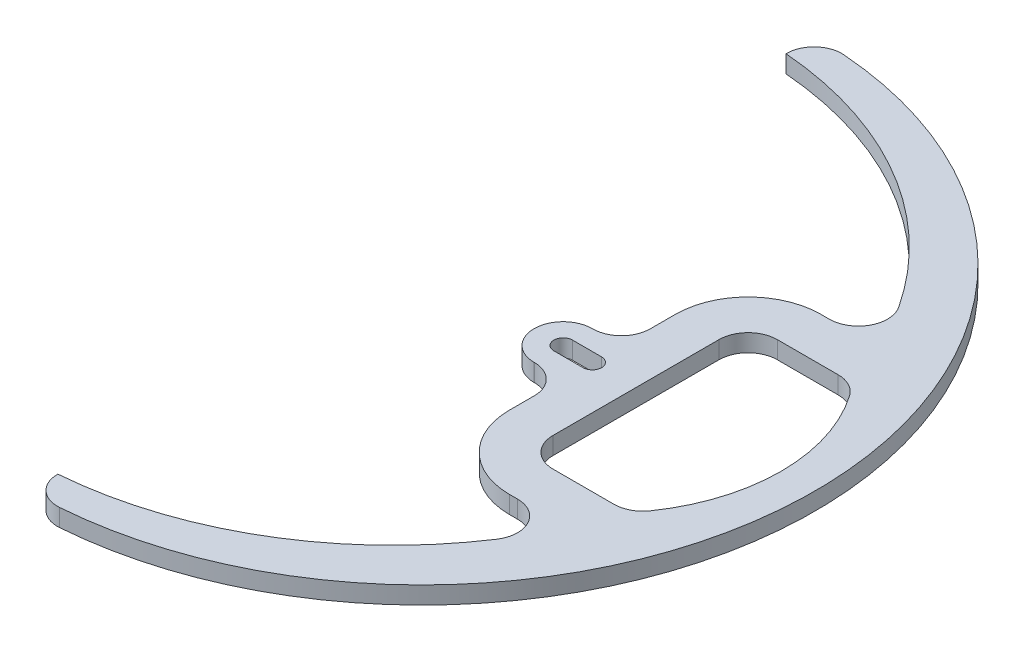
ISO-10303-21;
HEADER;
FILE_DESCRIPTION(('STEP AP214'),'2;1');
FILE_NAME('part.step','',(''),(''),'','','');
FILE_SCHEMA(('AUTOMOTIVE_DESIGN { 1 0 10303 214 1 1 1 1 }'));
ENDSEC;
DATA;
#1=APPLICATION_CONTEXT('core data for automotive mechanical design processes');
#2=APPLICATION_PROTOCOL_DEFINITION('international standard','automotive_design',2000,#1);
#3=PRODUCT_CONTEXT('',#1,'mechanical');
#4=PRODUCT('Part','Part','',(#3));
#5=PRODUCT_RELATED_PRODUCT_CATEGORY('part','',(#4));
#6=PRODUCT_DEFINITION_FORMATION('','',#4);
#7=PRODUCT_DEFINITION_CONTEXT('part definition',#1,'design');
#8=PRODUCT_DEFINITION('design','',#6,#7);
#9=PRODUCT_DEFINITION_SHAPE('','',#8);
#10=(LENGTH_UNIT() NAMED_UNIT(*) SI_UNIT(.MILLI.,.METRE.));
#11=(NAMED_UNIT(*) PLANE_ANGLE_UNIT() SI_UNIT($,.RADIAN.));
#12=(NAMED_UNIT(*) SI_UNIT($,.STERADIAN.) SOLID_ANGLE_UNIT());
#13=UNCERTAINTY_MEASURE_WITH_UNIT(LENGTH_MEASURE(1.E-05),#10,'distance_accuracy_value','');
#14=(GEOMETRIC_REPRESENTATION_CONTEXT(3) GLOBAL_UNCERTAINTY_ASSIGNED_CONTEXT((#13)) GLOBAL_UNIT_ASSIGNED_CONTEXT((#10,
#11,#12)) REPRESENTATION_CONTEXT('',''));
#15=CARTESIAN_POINT('',(0.,0.,0.));
#16=DIRECTION('',(0.,0.,1.));
#17=DIRECTION('',(1.,0.,0.));
#18=AXIS2_PLACEMENT_3D('',#15,#16,#17);
#19=CARTESIAN_POINT('',(40.,6.,0.));
#20=DIRECTION('',(0.,1.,0.));
#21=DIRECTION('',(0.,0.,1.));
#22=AXIS2_PLACEMENT_3D('',#19,#20,#21);
#23=PLANE('',#22);
#24=DIRECTION('',(-1.,0.,0.));
#25=VECTOR('',#24,1.);
#26=CARTESIAN_POINT('',(98.5,6.,-3.2));
#27=LINE('',#26,#25);
#28=CARTESIAN_POINT('',(108.5,6.,-3.2));
#29=VERTEX_POINT('',#28);
#30=CARTESIAN_POINT('',(98.5,6.,-3.2));
#31=VERTEX_POINT('',#30);
#32=EDGE_CURVE('E316',#29,#31,#27,.T.);
#33=ORIENTED_EDGE('',*,*,#32,.F.);
#34=CARTESIAN_POINT('',(108.5,6.,0.));
#35=DIRECTION('',(0.,1.,0.));
#36=DIRECTION('',(0.,0.,1.));
#37=AXIS2_PLACEMENT_3D('',#34,#35,#36);
#38=CIRCLE('',#37,3.2);
#39=CARTESIAN_POINT('',(108.5,6.,3.2));
#40=VERTEX_POINT('',#39);
#41=EDGE_CURVE('E314',#40,#29,#38,.T.);
#42=ORIENTED_EDGE('',*,*,#41,.F.);
#43=DIRECTION('',(1.,0.,0.));
#44=VECTOR('',#43,1.);
#45=CARTESIAN_POINT('',(98.5,6.,3.2));
#46=LINE('',#45,#44);
#47=CARTESIAN_POINT('',(98.5,6.,3.2));
#48=VERTEX_POINT('',#47);
#49=EDGE_CURVE('E321',#48,#40,#46,.T.);
#50=ORIENTED_EDGE('',*,*,#49,.F.);
#51=CARTESIAN_POINT('',(98.5,6.,0.));
#52=DIRECTION('',(0.,1.,0.));
#53=DIRECTION('',(0.,0.,1.));
#54=AXIS2_PLACEMENT_3D('',#51,#52,#53);
#55=CIRCLE('',#54,3.2);
#56=EDGE_CURVE('E318',#31,#48,#55,.T.);
#57=ORIENTED_EDGE('',*,*,#56,.F.);
#58=EDGE_LOOP('',(#33,#42,#50,#57));
#59=FACE_BOUND('',#58,.T.);
#60=CARTESIAN_POINT('',(40.,6.,0.));
#61=DIRECTION('',(0.,-1.,0.));
#62=DIRECTION('',(0.,0.,1.));
#63=AXIS2_PLACEMENT_3D('',#60,#61,#62);
#64=CIRCLE('',#63,125.399362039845);
#65=CARTESIAN_POINT('',(50.,6.,-125.));
#66=VERTEX_POINT('',#65);
#67=CARTESIAN_POINT('',(144.707387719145,6.,-69.0026300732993));
#68=VERTEX_POINT('',#67);
#69=EDGE_CURVE('E374',#66,#68,#64,.T.);
#70=ORIENTED_EDGE('',*,*,#69,.T.);
#71=CARTESIAN_POINT('',(136.357473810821,6.,-63.5));
#72=DIRECTION('',(0.,-1.,0.));
#73=DIRECTION('',(0.,0.,-1.));
#74=AXIS2_PLACEMENT_3D('',#71,#72,#73);
#75=CIRCLE('',#74,10.0000000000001);
#76=CARTESIAN_POINT('',(136.357473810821,6.,-53.4999999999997));
#77=VERTEX_POINT('',#76);
#78=EDGE_CURVE('E377',#68,#77,#75,.T.);
#79=ORIENTED_EDGE('',*,*,#78,.T.);
#80=DIRECTION('',(-1.,0.,0.));
#81=VECTOR('',#80,1.);
#82=CARTESIAN_POINT('',(133.5,6.,-53.4999999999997));
#83=LINE('',#82,#81);
#84=CARTESIAN_POINT('',(133.5,6.,-53.4999999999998));
#85=VERTEX_POINT('',#84);
#86=EDGE_CURVE('E379',#77,#85,#83,.T.);
#87=ORIENTED_EDGE('',*,*,#86,.T.);
#88=CARTESIAN_POINT('',(133.5,6.,-28.5));
#89=DIRECTION('',(0.,1.,0.));
#90=DIRECTION('',(0.,0.,-1.));
#91=AXIS2_PLACEMENT_3D('',#88,#89,#90);
#92=CIRCLE('',#91,24.9999999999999);
#93=CARTESIAN_POINT('',(108.5,6.,-28.4999999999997));
#94=VERTEX_POINT('',#93);
#95=EDGE_CURVE('E381',#85,#94,#92,.T.);
#96=ORIENTED_EDGE('',*,*,#95,.T.);
#97=DIRECTION('',(0.,0.,1.));
#98=VECTOR('',#97,1.);
#99=CARTESIAN_POINT('',(108.5,6.,-28.4999999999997));
#100=LINE('',#99,#98);
#101=CARTESIAN_POINT('',(108.5,6.,-19.9000000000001));
#102=VERTEX_POINT('',#101);
#103=EDGE_CURVE('E383',#94,#102,#100,.T.);
#104=ORIENTED_EDGE('',*,*,#103,.T.);
#105=CARTESIAN_POINT('',(98.6,6.,-19.9));
#106=DIRECTION('',(0.,-1.,0.));
#107=DIRECTION('',(0.,0.,1.));
#108=AXIS2_PLACEMENT_3D('',#105,#106,#107);
#109=CIRCLE('',#108,9.9);
#110=CARTESIAN_POINT('',(98.5999999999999,6.,-10.));
#111=VERTEX_POINT('',#110);
#112=EDGE_CURVE('E385',#102,#111,#109,.T.);
#113=ORIENTED_EDGE('',*,*,#112,.T.);
#114=DIRECTION('',(-1.,0.,0.));
#115=VECTOR('',#114,1.);
#116=CARTESIAN_POINT('',(98.5,6.,-10.));
#117=LINE('',#116,#115);
#118=CARTESIAN_POINT('',(98.5,6.,-10.));
#119=VERTEX_POINT('',#118);
#120=EDGE_CURVE('E387',#111,#119,#117,.T.);
#121=ORIENTED_EDGE('',*,*,#120,.T.);
#122=CARTESIAN_POINT('',(98.5,6.,0.));
#123=DIRECTION('',(0.,1.,0.));
#124=DIRECTION('',(0.,0.,1.));
#125=AXIS2_PLACEMENT_3D('',#122,#123,#124);
#126=CIRCLE('',#125,10.);
#127=CARTESIAN_POINT('',(98.5,6.,10.));
#128=VERTEX_POINT('',#127);
#129=EDGE_CURVE('E389',#119,#128,#126,.T.);
#130=ORIENTED_EDGE('',*,*,#129,.T.);
#131=DIRECTION('',(1.,0.,0.));
#132=VECTOR('',#131,1.);
#133=CARTESIAN_POINT('',(98.5,6.,10.));
#134=LINE('',#133,#132);
#135=CARTESIAN_POINT('',(98.5999999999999,6.,10.));
#136=VERTEX_POINT('',#135);
#137=EDGE_CURVE('E391',#128,#136,#134,.T.);
#138=ORIENTED_EDGE('',*,*,#137,.T.);
#139=CARTESIAN_POINT('',(98.6,6.,19.9));
#140=DIRECTION('',(0.,-1.,0.));
#141=DIRECTION('',(0.,0.,1.));
#142=AXIS2_PLACEMENT_3D('',#139,#140,#141);
#143=CIRCLE('',#142,9.9);
#144=CARTESIAN_POINT('',(108.5,6.,19.9000000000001));
#145=VERTEX_POINT('',#144);
#146=EDGE_CURVE('E393',#136,#145,#143,.T.);
#147=ORIENTED_EDGE('',*,*,#146,.T.);
#148=DIRECTION('',(0.,0.,1.));
#149=VECTOR('',#148,1.);
#150=CARTESIAN_POINT('',(108.5,6.,19.9000000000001));
#151=LINE('',#150,#149);
#152=CARTESIAN_POINT('',(108.5,6.,28.4999999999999));
#153=VERTEX_POINT('',#152);
#154=EDGE_CURVE('E395',#145,#153,#151,.T.);
#155=ORIENTED_EDGE('',*,*,#154,.T.);
#156=CARTESIAN_POINT('',(133.5,6.,28.5));
#157=DIRECTION('',(0.,1.,0.));
#158=DIRECTION('',(0.,0.,1.));
#159=AXIS2_PLACEMENT_3D('',#156,#157,#158);
#160=CIRCLE('',#159,25.);
#161=CARTESIAN_POINT('',(133.5,6.,53.4999999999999));
#162=VERTEX_POINT('',#161);
#163=EDGE_CURVE('E397',#153,#162,#160,.T.);
#164=ORIENTED_EDGE('',*,*,#163,.T.);
#165=DIRECTION('',(1.,0.,0.));
#166=VECTOR('',#165,1.);
#167=CARTESIAN_POINT('',(133.5,6.,53.4999999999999));
#168=LINE('',#167,#166);
#169=CARTESIAN_POINT('',(136.357473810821,6.,53.4999999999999));
#170=VERTEX_POINT('',#169);
#171=EDGE_CURVE('E399',#162,#170,#168,.T.);
#172=ORIENTED_EDGE('',*,*,#171,.T.);
#173=CARTESIAN_POINT('',(136.357473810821,6.,63.5));
#174=DIRECTION('',(0.,-1.,0.));
#175=DIRECTION('',(0.,0.,1.));
#176=AXIS2_PLACEMENT_3D('',#173,#174,#175);
#177=CIRCLE('',#176,10.0000000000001);
#178=CARTESIAN_POINT('',(144.707387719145,6.,69.0026300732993));
#179=VERTEX_POINT('',#178);
#180=EDGE_CURVE('E401',#170,#179,#177,.T.);
#181=ORIENTED_EDGE('',*,*,#180,.T.);
#182=CARTESIAN_POINT('',(40.,6.,0.));
#183=DIRECTION('',(0.,-1.,0.));
#184=DIRECTION('',(0.,0.,1.));
#185=AXIS2_PLACEMENT_3D('',#182,#183,#184);
#186=CIRCLE('',#185,125.399362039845);
#187=CARTESIAN_POINT('',(50.,6.,125.));
#188=VERTEX_POINT('',#187);
#189=EDGE_CURVE('E403',#179,#188,#186,.T.);
#190=ORIENTED_EDGE('',*,*,#189,.T.);
#191=DIRECTION('',(0.,0.,1.));
#192=VECTOR('',#191,1.);
#193=CARTESIAN_POINT('',(50.,6.,125.));
#194=LINE('',#193,#192);
#195=CARTESIAN_POINT('',(50.,6.,125.139921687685));
#196=VERTEX_POINT('',#195);
#197=EDGE_CURVE('E405',#188,#196,#194,.T.);
#198=ORIENTED_EDGE('',*,*,#197,.T.);
#199=CARTESIAN_POINT('',(59.5,6.,125.139921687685));
#200=DIRECTION('',(0.,1.,0.));
#201=DIRECTION('',(0.,0.,1.));
#202=AXIS2_PLACEMENT_3D('',#199,#200,#201);
#203=CIRCLE('',#202,9.5);
#204=CARTESIAN_POINT('',(60.2191235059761,6.,134.612664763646));
#205=VERTEX_POINT('',#204);
#206=EDGE_CURVE('E407',#196,#205,#203,.T.);
#207=ORIENTED_EDGE('',*,*,#206,.T.);
#208=CARTESIAN_POINT('',(50.,6.,0.));
#209=DIRECTION('',(0.,1.,0.));
#210=DIRECTION('',(0.,0.,1.));
#211=AXIS2_PLACEMENT_3D('',#208,#209,#210);
#212=CIRCLE('',#211,135.);
#213=CARTESIAN_POINT('',(60.2191235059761,6.,-134.612664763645));
#214=VERTEX_POINT('',#213);
#215=EDGE_CURVE('E409',#205,#214,#212,.T.);
#216=ORIENTED_EDGE('',*,*,#215,.T.);
#217=CARTESIAN_POINT('',(59.5,6.,-125.139921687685));
#218=DIRECTION('',(0.,1.,0.));
#219=DIRECTION('',(0.,0.,-1.));
#220=AXIS2_PLACEMENT_3D('',#217,#218,#219);
#221=CIRCLE('',#220,9.5);
#222=CARTESIAN_POINT('',(50.,6.,-125.139921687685));
#223=VERTEX_POINT('',#222);
#224=EDGE_CURVE('E411',#214,#223,#221,.T.);
#225=ORIENTED_EDGE('',*,*,#224,.T.);
#226=DIRECTION('',(0.,0.,1.));
#227=VECTOR('',#226,1.);
#228=CARTESIAN_POINT('',(50.,6.,-125.139921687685));
#229=LINE('',#228,#227);
#230=EDGE_CURVE('E413',#223,#66,#229,.T.);
#231=ORIENTED_EDGE('',*,*,#230,.T.);
#232=EDGE_LOOP('',(#70,#79,#87,#96,#104,#113,#121,#130,#138,#147,#155,#164,#172,#181,#190,#198,
#207,#216,#225,#231));
#233=FACE_BOUND('',#232,.T.);
#234=CARTESIAN_POINT('',(113.323975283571,6.,1.65726909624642E-11));
#235=DIRECTION('',(0.,1.,0.));
#236=DIRECTION('',(0.,0.,-1.));
#237=AXIS2_PLACEMENT_3D('',#234,#235,#236);
#238=CIRCLE('',#237,59.9999999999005);
#239=CARTESIAN_POINT('',(162.622656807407,6.,34.200000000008));
#240=VERTEX_POINT('',#239);
#241=CARTESIAN_POINT('',(162.62265680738,6.,-34.2000000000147));
#242=VERTEX_POINT('',#241);
#243=EDGE_CURVE('E277',#240,#242,#238,.T.);
#244=ORIENTED_EDGE('',*,*,#243,.F.);
#245=CARTESIAN_POINT('',(154.406209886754,6.,28.5));
#246=DIRECTION('',(0.,1.,0.));
#247=DIRECTION('',(0.,0.,1.));
#248=AXIS2_PLACEMENT_3D('',#245,#246,#247);
#249=CIRCLE('',#248,10.);
#250=CARTESIAN_POINT('',(154.406209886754,6.,38.5));
#251=VERTEX_POINT('',#250);
#252=EDGE_CURVE('E254',#251,#240,#249,.T.);
#253=ORIENTED_EDGE('',*,*,#252,.F.);
#254=DIRECTION('',(1.,0.,0.));
#255=VECTOR('',#254,1.);
#256=CARTESIAN_POINT('',(133.499999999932,6.,38.5));
#257=LINE('',#256,#255);
#258=CARTESIAN_POINT('',(133.499999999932,6.,38.5));
#259=VERTEX_POINT('',#258);
#260=EDGE_CURVE('E289',#259,#251,#257,.T.);
#261=ORIENTED_EDGE('',*,*,#260,.F.);
#262=CARTESIAN_POINT('',(133.499999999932,6.,28.5000000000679));
#263=DIRECTION('',(0.,1.,0.));
#264=DIRECTION('',(0.,0.,1.));
#265=AXIS2_PLACEMENT_3D('',#262,#263,#264);
#266=CIRCLE('',#265,9.99999999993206);
#267=CARTESIAN_POINT('',(123.5,6.,28.5000000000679));
#268=VERTEX_POINT('',#267);
#269=EDGE_CURVE('E287',#268,#259,#266,.T.);
#270=ORIENTED_EDGE('',*,*,#269,.F.);
#271=DIRECTION('',(0.,0.,1.));
#272=VECTOR('',#271,1.);
#273=CARTESIAN_POINT('',(123.5,6.,-28.5000000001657));
#274=LINE('',#273,#272);
#275=CARTESIAN_POINT('',(123.5,6.,-28.5000000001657));
#276=VERTEX_POINT('',#275);
#277=EDGE_CURVE('E285',#276,#268,#274,.T.);
#278=ORIENTED_EDGE('',*,*,#277,.F.);
#279=CARTESIAN_POINT('',(133.499999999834,6.,-28.5000000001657));
#280=DIRECTION('',(0.,1.,0.));
#281=DIRECTION('',(0.,0.,1.));
#282=AXIS2_PLACEMENT_3D('',#279,#280,#281);
#283=CIRCLE('',#282,9.9999999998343);
#284=CARTESIAN_POINT('',(133.499999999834,6.,-38.5));
#285=VERTEX_POINT('',#284);
#286=EDGE_CURVE('E283',#285,#276,#283,.T.);
#287=ORIENTED_EDGE('',*,*,#286,.F.);
#288=DIRECTION('',(-1.,0.,0.));
#289=VECTOR('',#288,1.);
#290=CARTESIAN_POINT('',(154.406209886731,6.,-38.5));
#291=LINE('',#290,#289);
#292=CARTESIAN_POINT('',(154.406209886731,6.,-38.5));
#293=VERTEX_POINT('',#292);
#294=EDGE_CURVE('E281',#293,#285,#291,.T.);
#295=ORIENTED_EDGE('',*,*,#294,.F.);
#296=CARTESIAN_POINT('',(154.406209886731,6.,-28.5));
#297=DIRECTION('',(0.,1.,0.));
#298=DIRECTION('',(0.,0.,-1.));
#299=AXIS2_PLACEMENT_3D('',#296,#297,#298);
#300=CIRCLE('',#299,10.);
#301=EDGE_CURVE('E279',#242,#293,#300,.T.);
#302=ORIENTED_EDGE('',*,*,#301,.F.);
#303=EDGE_LOOP('',(#244,#253,#261,#270,#278,#287,#295,#302));
#304=FACE_BOUND('',#303,.T.);
#305=ADVANCED_FACE('F30',(#59,#233,#304),#23,.T.);
#306=CARTESIAN_POINT('',(40.,0.,0.));
#307=DIRECTION('',(0.,1.,0.));
#308=DIRECTION('',(0.,0.,1.));
#309=AXIS2_PLACEMENT_3D('',#306,#307,#308);
#310=PLANE('',#309);
#311=CARTESIAN_POINT('',(108.5,0.,0.));
#312=DIRECTION('',(0.,1.,0.));
#313=DIRECTION('',(0.,0.,1.));
#314=AXIS2_PLACEMENT_3D('',#311,#312,#313);
#315=CIRCLE('',#314,3.2);
#316=CARTESIAN_POINT('',(108.5,0.,3.2));
#317=VERTEX_POINT('',#316);
#318=CARTESIAN_POINT('',(108.5,0.,-3.2));
#319=VERTEX_POINT('',#318);
#320=EDGE_CURVE('E255',#317,#319,#315,.T.);
#321=ORIENTED_EDGE('',*,*,#320,.T.);
#322=DIRECTION('',(-1.,0.,0.));
#323=VECTOR('',#322,1.);
#324=CARTESIAN_POINT('',(98.5,0.,-3.2));
#325=LINE('',#324,#323);
#326=CARTESIAN_POINT('',(98.5,0.,-3.2));
#327=VERTEX_POINT('',#326);
#328=EDGE_CURVE('E305',#319,#327,#325,.T.);
#329=ORIENTED_EDGE('',*,*,#328,.T.);
#330=CARTESIAN_POINT('',(98.5,0.,0.));
#331=DIRECTION('',(0.,1.,0.));
#332=DIRECTION('',(0.,0.,1.));
#333=AXIS2_PLACEMENT_3D('',#330,#331,#332);
#334=CIRCLE('',#333,3.2);
#335=CARTESIAN_POINT('',(98.5,0.,3.2));
#336=VERTEX_POINT('',#335);
#337=EDGE_CURVE('E308',#327,#336,#334,.T.);
#338=ORIENTED_EDGE('',*,*,#337,.T.);
#339=DIRECTION('',(1.,0.,0.));
#340=VECTOR('',#339,1.);
#341=CARTESIAN_POINT('',(98.5,0.,3.2));
#342=LINE('',#341,#340);
#343=EDGE_CURVE('E311',#336,#317,#342,.T.);
#344=ORIENTED_EDGE('',*,*,#343,.T.);
#345=EDGE_LOOP('',(#321,#329,#338,#344));
#346=FACE_BOUND('',#345,.T.);
#347=CARTESIAN_POINT('',(40.,0.,0.));
#348=DIRECTION('',(0.,-1.,0.));
#349=DIRECTION('',(0.,0.,1.));
#350=AXIS2_PLACEMENT_3D('',#347,#348,#349);
#351=CIRCLE('',#350,125.399362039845);
#352=CARTESIAN_POINT('',(50.,0.,-125.));
#353=VERTEX_POINT('',#352);
#354=CARTESIAN_POINT('',(144.707387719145,0.,-69.0026300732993));
#355=VERTEX_POINT('',#354);
#356=EDGE_CURVE('E333',#353,#355,#351,.T.);
#357=ORIENTED_EDGE('',*,*,#356,.F.);
#358=DIRECTION('',(0.,0.,1.));
#359=VECTOR('',#358,1.);
#360=CARTESIAN_POINT('',(50.,0.,-125.139921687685));
#361=LINE('',#360,#359);
#362=CARTESIAN_POINT('',(50.,0.,-125.139921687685));
#363=VERTEX_POINT('',#362);
#364=EDGE_CURVE('E372',#363,#353,#361,.T.);
#365=ORIENTED_EDGE('',*,*,#364,.F.);
#366=CARTESIAN_POINT('',(59.5,0.,-125.139921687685));
#367=DIRECTION('',(0.,1.,0.));
#368=DIRECTION('',(0.,0.,-1.));
#369=AXIS2_PLACEMENT_3D('',#366,#367,#368);
#370=CIRCLE('',#369,9.5);
#371=CARTESIAN_POINT('',(60.2191235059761,0.,-134.612664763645));
#372=VERTEX_POINT('',#371);
#373=EDGE_CURVE('E370',#372,#363,#370,.T.);
#374=ORIENTED_EDGE('',*,*,#373,.F.);
#375=CARTESIAN_POINT('',(50.,0.,0.));
#376=DIRECTION('',(0.,1.,0.));
#377=DIRECTION('',(0.,0.,1.));
#378=AXIS2_PLACEMENT_3D('',#375,#376,#377);
#379=CIRCLE('',#378,135.);
#380=CARTESIAN_POINT('',(60.2191235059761,0.,134.612664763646));
#381=VERTEX_POINT('',#380);
#382=EDGE_CURVE('E368',#381,#372,#379,.T.);
#383=ORIENTED_EDGE('',*,*,#382,.F.);
#384=CARTESIAN_POINT('',(59.5,0.,125.139921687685));
#385=DIRECTION('',(0.,1.,0.));
#386=DIRECTION('',(0.,0.,1.));
#387=AXIS2_PLACEMENT_3D('',#384,#385,#386);
#388=CIRCLE('',#387,9.5);
#389=CARTESIAN_POINT('',(50.,0.,125.139921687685));
#390=VERTEX_POINT('',#389);
#391=EDGE_CURVE('E366',#390,#381,#388,.T.);
#392=ORIENTED_EDGE('',*,*,#391,.F.);
#393=DIRECTION('',(0.,0.,1.));
#394=VECTOR('',#393,1.);
#395=CARTESIAN_POINT('',(50.,0.,125.));
#396=LINE('',#395,#394);
#397=CARTESIAN_POINT('',(50.,0.,125.));
#398=VERTEX_POINT('',#397);
#399=EDGE_CURVE('E364',#398,#390,#396,.T.);
#400=ORIENTED_EDGE('',*,*,#399,.F.);
#401=CARTESIAN_POINT('',(40.,0.,0.));
#402=DIRECTION('',(0.,-1.,0.));
#403=DIRECTION('',(0.,0.,1.));
#404=AXIS2_PLACEMENT_3D('',#401,#402,#403);
#405=CIRCLE('',#404,125.399362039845);
#406=CARTESIAN_POINT('',(144.707387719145,0.,69.0026300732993));
#407=VERTEX_POINT('',#406);
#408=EDGE_CURVE('E362',#407,#398,#405,.T.);
#409=ORIENTED_EDGE('',*,*,#408,.F.);
#410=CARTESIAN_POINT('',(136.357473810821,0.,63.5));
#411=DIRECTION('',(0.,-1.,0.));
#412=DIRECTION('',(0.,0.,1.));
#413=AXIS2_PLACEMENT_3D('',#410,#411,#412);
#414=CIRCLE('',#413,10.0000000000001);
#415=CARTESIAN_POINT('',(136.357473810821,0.,53.4999999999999));
#416=VERTEX_POINT('',#415);
#417=EDGE_CURVE('E360',#416,#407,#414,.T.);
#418=ORIENTED_EDGE('',*,*,#417,.F.);
#419=DIRECTION('',(1.,0.,0.));
#420=VECTOR('',#419,1.);
#421=CARTESIAN_POINT('',(133.5,0.,53.4999999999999));
#422=LINE('',#421,#420);
#423=CARTESIAN_POINT('',(133.5,0.,53.4999999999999));
#424=VERTEX_POINT('',#423);
#425=EDGE_CURVE('E358',#424,#416,#422,.T.);
#426=ORIENTED_EDGE('',*,*,#425,.F.);
#427=CARTESIAN_POINT('',(133.5,0.,28.5));
#428=DIRECTION('',(0.,1.,0.));
#429=DIRECTION('',(0.,0.,1.));
#430=AXIS2_PLACEMENT_3D('',#427,#428,#429);
#431=CIRCLE('',#430,25.);
#432=CARTESIAN_POINT('',(108.5,0.,28.4999999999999));
#433=VERTEX_POINT('',#432);
#434=EDGE_CURVE('E356',#433,#424,#431,.T.);
#435=ORIENTED_EDGE('',*,*,#434,.F.);
#436=DIRECTION('',(0.,0.,1.));
#437=VECTOR('',#436,1.);
#438=CARTESIAN_POINT('',(108.5,0.,19.9000000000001));
#439=LINE('',#438,#437);
#440=CARTESIAN_POINT('',(108.5,0.,19.9000000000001));
#441=VERTEX_POINT('',#440);
#442=EDGE_CURVE('E354',#441,#433,#439,.T.);
#443=ORIENTED_EDGE('',*,*,#442,.F.);
#444=CARTESIAN_POINT('',(98.6,0.,19.9));
#445=DIRECTION('',(0.,-1.,0.));
#446=DIRECTION('',(0.,0.,1.));
#447=AXIS2_PLACEMENT_3D('',#444,#445,#446);
#448=CIRCLE('',#447,9.9);
#449=CARTESIAN_POINT('',(98.5999999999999,0.,10.));
#450=VERTEX_POINT('',#449);
#451=EDGE_CURVE('E352',#450,#441,#448,.T.);
#452=ORIENTED_EDGE('',*,*,#451,.F.);
#453=DIRECTION('',(1.,0.,0.));
#454=VECTOR('',#453,1.);
#455=CARTESIAN_POINT('',(98.5,0.,10.));
#456=LINE('',#455,#454);
#457=CARTESIAN_POINT('',(98.5,0.,10.));
#458=VERTEX_POINT('',#457);
#459=EDGE_CURVE('E350',#458,#450,#456,.T.);
#460=ORIENTED_EDGE('',*,*,#459,.F.);
#461=CARTESIAN_POINT('',(98.5,0.,0.));
#462=DIRECTION('',(0.,1.,0.));
#463=DIRECTION('',(0.,0.,1.));
#464=AXIS2_PLACEMENT_3D('',#461,#462,#463);
#465=CIRCLE('',#464,10.);
#466=CARTESIAN_POINT('',(98.5,0.,-10.));
#467=VERTEX_POINT('',#466);
#468=EDGE_CURVE('E348',#467,#458,#465,.T.);
#469=ORIENTED_EDGE('',*,*,#468,.F.);
#470=DIRECTION('',(-1.,0.,0.));
#471=VECTOR('',#470,1.);
#472=CARTESIAN_POINT('',(98.5,0.,-10.));
#473=LINE('',#472,#471);
#474=CARTESIAN_POINT('',(98.5999999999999,0.,-10.));
#475=VERTEX_POINT('',#474);
#476=EDGE_CURVE('E346',#475,#467,#473,.T.);
#477=ORIENTED_EDGE('',*,*,#476,.F.);
#478=CARTESIAN_POINT('',(98.6,0.,-19.9));
#479=DIRECTION('',(0.,-1.,0.));
#480=DIRECTION('',(0.,0.,1.));
#481=AXIS2_PLACEMENT_3D('',#478,#479,#480);
#482=CIRCLE('',#481,9.9);
#483=CARTESIAN_POINT('',(108.5,0.,-19.9000000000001));
#484=VERTEX_POINT('',#483);
#485=EDGE_CURVE('E344',#484,#475,#482,.T.);
#486=ORIENTED_EDGE('',*,*,#485,.F.);
#487=DIRECTION('',(0.,0.,1.));
#488=VECTOR('',#487,1.);
#489=CARTESIAN_POINT('',(108.5,0.,-28.4999999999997));
#490=LINE('',#489,#488);
#491=CARTESIAN_POINT('',(108.5,0.,-28.4999999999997));
#492=VERTEX_POINT('',#491);
#493=EDGE_CURVE('E342',#492,#484,#490,.T.);
#494=ORIENTED_EDGE('',*,*,#493,.F.);
#495=CARTESIAN_POINT('',(133.5,0.,-28.5));
#496=DIRECTION('',(0.,1.,0.));
#497=DIRECTION('',(0.,0.,-1.));
#498=AXIS2_PLACEMENT_3D('',#495,#496,#497);
#499=CIRCLE('',#498,24.9999999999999);
#500=CARTESIAN_POINT('',(133.5,0.,-53.4999999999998));
#501=VERTEX_POINT('',#500);
#502=EDGE_CURVE('E340',#501,#492,#499,.T.);
#503=ORIENTED_EDGE('',*,*,#502,.F.);
#504=DIRECTION('',(-1.,0.,0.));
#505=VECTOR('',#504,1.);
#506=CARTESIAN_POINT('',(133.5,0.,-53.4999999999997));
#507=LINE('',#506,#505);
#508=CARTESIAN_POINT('',(136.357473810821,0.,-53.4999999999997));
#509=VERTEX_POINT('',#508);
#510=EDGE_CURVE('E338',#509,#501,#507,.T.);
#511=ORIENTED_EDGE('',*,*,#510,.F.);
#512=CARTESIAN_POINT('',(136.357473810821,0.,-63.5));
#513=DIRECTION('',(0.,-1.,0.));
#514=DIRECTION('',(0.,0.,-1.));
#515=AXIS2_PLACEMENT_3D('',#512,#513,#514);
#516=CIRCLE('',#515,10.0000000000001);
#517=EDGE_CURVE('E336',#355,#509,#516,.T.);
#518=ORIENTED_EDGE('',*,*,#517,.F.);
#519=EDGE_LOOP('',(#357,#365,#374,#383,#392,#400,#409,#418,#426,#435,#443,#452,#460,#469,#477,
#486,#494,#503,#511,#518));
#520=FACE_BOUND('',#519,.T.);
#521=CARTESIAN_POINT('',(154.406209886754,0.,28.5));
#522=DIRECTION('',(0.,1.,0.));
#523=DIRECTION('',(0.,0.,1.));
#524=AXIS2_PLACEMENT_3D('',#521,#522,#523);
#525=CIRCLE('',#524,10.);
#526=CARTESIAN_POINT('',(154.406209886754,0.,38.5));
#527=VERTEX_POINT('',#526);
#528=CARTESIAN_POINT('',(162.622656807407,0.,34.200000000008));
#529=VERTEX_POINT('',#528);
#530=EDGE_CURVE('E53',#527,#529,#525,.T.);
#531=ORIENTED_EDGE('',*,*,#530,.T.);
#532=CARTESIAN_POINT('',(113.323975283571,0.,1.65726909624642E-11));
#533=DIRECTION('',(0.,1.,0.));
#534=DIRECTION('',(0.,0.,-1.));
#535=AXIS2_PLACEMENT_3D('',#532,#533,#534);
#536=CIRCLE('',#535,59.9999999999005);
#537=CARTESIAN_POINT('',(162.62265680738,0.,-34.2000000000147));
#538=VERTEX_POINT('',#537);
#539=EDGE_CURVE('E241',#529,#538,#536,.T.);
#540=ORIENTED_EDGE('',*,*,#539,.T.);
#541=CARTESIAN_POINT('',(154.406209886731,0.,-28.5));
#542=DIRECTION('',(0.,1.,0.));
#543=DIRECTION('',(0.,0.,-1.));
#544=AXIS2_PLACEMENT_3D('',#541,#542,#543);
#545=CIRCLE('',#544,10.);
#546=CARTESIAN_POINT('',(154.406209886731,0.,-38.5));
#547=VERTEX_POINT('',#546);
#548=EDGE_CURVE('E250',#538,#547,#545,.T.);
#549=ORIENTED_EDGE('',*,*,#548,.T.);
#550=DIRECTION('',(-1.,0.,0.));
#551=VECTOR('',#550,1.);
#552=CARTESIAN_POINT('',(154.406209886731,0.,-38.5));
#553=LINE('',#552,#551);
#554=CARTESIAN_POINT('',(133.499999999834,0.,-38.5));
#555=VERTEX_POINT('',#554);
#556=EDGE_CURVE('E264',#547,#555,#553,.T.);
#557=ORIENTED_EDGE('',*,*,#556,.T.);
#558=CARTESIAN_POINT('',(133.499999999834,0.,-28.5000000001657));
#559=DIRECTION('',(0.,1.,0.));
#560=DIRECTION('',(0.,0.,1.));
#561=AXIS2_PLACEMENT_3D('',#558,#559,#560);
#562=CIRCLE('',#561,9.9999999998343);
#563=CARTESIAN_POINT('',(123.5,0.,-28.5000000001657));
#564=VERTEX_POINT('',#563);
#565=EDGE_CURVE('E267',#555,#564,#562,.T.);
#566=ORIENTED_EDGE('',*,*,#565,.T.);
#567=DIRECTION('',(0.,0.,1.));
#568=VECTOR('',#567,1.);
#569=CARTESIAN_POINT('',(123.5,0.,-28.5000000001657));
#570=LINE('',#569,#568);
#571=CARTESIAN_POINT('',(123.5,0.,28.5000000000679));
#572=VERTEX_POINT('',#571);
#573=EDGE_CURVE('E270',#564,#572,#570,.T.);
#574=ORIENTED_EDGE('',*,*,#573,.T.);
#575=CARTESIAN_POINT('',(133.499999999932,0.,28.5000000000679));
#576=DIRECTION('',(0.,1.,0.));
#577=DIRECTION('',(0.,0.,1.));
#578=AXIS2_PLACEMENT_3D('',#575,#576,#577);
#579=CIRCLE('',#578,9.99999999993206);
#580=CARTESIAN_POINT('',(133.499999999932,0.,38.5));
#581=VERTEX_POINT('',#580);
#582=EDGE_CURVE('E273',#572,#581,#579,.T.);
#583=ORIENTED_EDGE('',*,*,#582,.T.);
#584=DIRECTION('',(1.,0.,0.));
#585=VECTOR('',#584,1.);
#586=CARTESIAN_POINT('',(133.499999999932,0.,38.5));
#587=LINE('',#586,#585);
#588=EDGE_CURVE('E260',#581,#527,#587,.T.);
#589=ORIENTED_EDGE('',*,*,#588,.T.);
#590=EDGE_LOOP('',(#531,#540,#549,#557,#566,#574,#583,#589));
#591=FACE_BOUND('',#590,.T.);
#592=ADVANCED_FACE('F258',(#346,#520,#591),#310,.F.);
#593=CARTESIAN_POINT('',(40.,6.,0.));
#594=DIRECTION('',(0.,-1.,0.));
#595=DIRECTION('',(0.,0.,-1.));
#596=AXIS2_PLACEMENT_3D('',#593,#594,#595);
#597=CYLINDRICAL_SURFACE('',#596,125.399362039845);
#598=ORIENTED_EDGE('',*,*,#356,.T.);
#599=DIRECTION('',(0.,-1.,0.));
#600=VECTOR('',#599,1.);
#601=CARTESIAN_POINT('',(144.707387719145,6.,-69.0026300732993));
#602=LINE('',#601,#600);
#603=EDGE_CURVE('E11',#68,#355,#602,.T.);
#604=ORIENTED_EDGE('',*,*,#603,.F.);
#605=ORIENTED_EDGE('',*,*,#69,.F.);
#606=DIRECTION('',(0.,-1.,0.));
#607=VECTOR('',#606,1.);
#608=CARTESIAN_POINT('',(50.,6.,-125.));
#609=LINE('',#608,#607);
#610=EDGE_CURVE('E415',#66,#353,#609,.T.);
#611=ORIENTED_EDGE('',*,*,#610,.T.);
#612=EDGE_LOOP('',(#598,#604,#605,#611));
#613=FACE_BOUND('',#612,.T.);
#614=ADVANCED_FACE('F32',(#613),#597,.F.);
#615=CARTESIAN_POINT('',(136.357473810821,6.,-63.5));
#616=DIRECTION('',(0.,-1.,0.));
#617=DIRECTION('',(0.,0.,-1.));
#618=AXIS2_PLACEMENT_3D('',#615,#616,#617);
#619=CYLINDRICAL_SURFACE('',#618,10.0000000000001);
#620=ORIENTED_EDGE('',*,*,#517,.T.);
#621=DIRECTION('',(0.,-1.,0.));
#622=VECTOR('',#621,1.);
#623=CARTESIAN_POINT('',(136.357473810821,6.,-53.4999999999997));
#624=LINE('',#623,#622);
#625=EDGE_CURVE('E38',#77,#509,#624,.T.);
#626=ORIENTED_EDGE('',*,*,#625,.F.);
#627=ORIENTED_EDGE('',*,*,#78,.F.);
#628=ORIENTED_EDGE('',*,*,#603,.T.);
#629=EDGE_LOOP('',(#620,#626,#627,#628));
#630=FACE_BOUND('',#629,.T.);
#631=ADVANCED_FACE('F495',(#630),#619,.F.);
#632=CARTESIAN_POINT('',(133.5,6.,-53.4999999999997));
#633=DIRECTION('',(0.,0.,1.));
#634=DIRECTION('',(1.,0.,0.));
#635=AXIS2_PLACEMENT_3D('',#632,#633,#634);
#636=PLANE('',#635);
#637=ORIENTED_EDGE('',*,*,#510,.T.);
#638=DIRECTION('',(0.,-1.,0.));
#639=VECTOR('',#638,1.);
#640=CARTESIAN_POINT('',(133.5,6.,-53.4999999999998));
#641=LINE('',#640,#639);
#642=EDGE_CURVE('E466',#85,#501,#641,.T.);
#643=ORIENTED_EDGE('',*,*,#642,.F.);
#644=ORIENTED_EDGE('',*,*,#86,.F.);
#645=ORIENTED_EDGE('',*,*,#625,.T.);
#646=EDGE_LOOP('',(#637,#643,#644,#645));
#647=FACE_BOUND('',#646,.T.);
#648=ADVANCED_FACE('F473',(#647),#636,.F.);
#649=CARTESIAN_POINT('',(133.5,6.,-28.5));
#650=DIRECTION('',(0.,-1.,0.));
#651=DIRECTION('',(0.,0.,-1.));
#652=AXIS2_PLACEMENT_3D('',#649,#650,#651);
#653=CYLINDRICAL_SURFACE('',#652,24.9999999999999);
#654=ORIENTED_EDGE('',*,*,#502,.T.);
#655=DIRECTION('',(0.,-1.,0.));
#656=VECTOR('',#655,1.);
#657=CARTESIAN_POINT('',(108.5,6.,-28.4999999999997));
#658=LINE('',#657,#656);
#659=EDGE_CURVE('E463',#94,#492,#658,.T.);
#660=ORIENTED_EDGE('',*,*,#659,.F.);
#661=ORIENTED_EDGE('',*,*,#95,.F.);
#662=ORIENTED_EDGE('',*,*,#642,.T.);
#663=EDGE_LOOP('',(#654,#660,#661,#662));
#664=FACE_BOUND('',#663,.T.);
#665=ADVANCED_FACE('F483',(#664),#653,.T.);
#666=CARTESIAN_POINT('',(108.5,6.,-28.4999999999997));
#667=DIRECTION('',(1.,0.,0.));
#668=DIRECTION('',(0.,0.,-1.));
#669=AXIS2_PLACEMENT_3D('',#666,#667,#668);
#670=PLANE('',#669);
#671=ORIENTED_EDGE('',*,*,#493,.T.);
#672=DIRECTION('',(0.,-1.,0.));
#673=VECTOR('',#672,1.);
#674=CARTESIAN_POINT('',(108.5,6.,-19.9000000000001));
#675=LINE('',#674,#673);
#676=EDGE_CURVE('E460',#102,#484,#675,.T.);
#677=ORIENTED_EDGE('',*,*,#676,.F.);
#678=ORIENTED_EDGE('',*,*,#103,.F.);
#679=ORIENTED_EDGE('',*,*,#659,.T.);
#680=EDGE_LOOP('',(#671,#677,#678,#679));
#681=FACE_BOUND('',#680,.T.);
#682=ADVANCED_FACE('F487',(#681),#670,.F.);
#683=CARTESIAN_POINT('',(98.6,6.,-19.9));
#684=DIRECTION('',(0.,-1.,0.));
#685=DIRECTION('',(0.,0.,-1.));
#686=AXIS2_PLACEMENT_3D('',#683,#684,#685);
#687=CYLINDRICAL_SURFACE('',#686,9.9);
#688=ORIENTED_EDGE('',*,*,#485,.T.);
#689=DIRECTION('',(0.,-1.,0.));
#690=VECTOR('',#689,1.);
#691=CARTESIAN_POINT('',(98.5999999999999,6.,-10.));
#692=LINE('',#691,#690);
#693=EDGE_CURVE('E457',#111,#475,#692,.T.);
#694=ORIENTED_EDGE('',*,*,#693,.F.);
#695=ORIENTED_EDGE('',*,*,#112,.F.);
#696=ORIENTED_EDGE('',*,*,#676,.T.);
#697=EDGE_LOOP('',(#688,#694,#695,#696));
#698=FACE_BOUND('',#697,.T.);
#699=ADVANCED_FACE('F568',(#698),#687,.F.);
#700=CARTESIAN_POINT('',(98.5,6.,-10.));
#701=DIRECTION('',(0.,0.,1.));
#702=DIRECTION('',(1.,0.,0.));
#703=AXIS2_PLACEMENT_3D('',#700,#701,#702);
#704=PLANE('',#703);
#705=ORIENTED_EDGE('',*,*,#476,.T.);
#706=DIRECTION('',(0.,-1.,0.));
#707=VECTOR('',#706,1.);
#708=CARTESIAN_POINT('',(98.5,6.,-10.));
#709=LINE('',#708,#707);
#710=EDGE_CURVE('E454',#119,#467,#709,.T.);
#711=ORIENTED_EDGE('',*,*,#710,.F.);
#712=ORIENTED_EDGE('',*,*,#120,.F.);
#713=ORIENTED_EDGE('',*,*,#693,.T.);
#714=EDGE_LOOP('',(#705,#711,#712,#713));
#715=FACE_BOUND('',#714,.T.);
#716=ADVANCED_FACE('F566',(#715),#704,.F.);
#717=CARTESIAN_POINT('',(98.5,6.,0.));
#718=DIRECTION('',(0.,-1.,0.));
#719=DIRECTION('',(0.,0.,-1.));
#720=AXIS2_PLACEMENT_3D('',#717,#718,#719);
#721=CYLINDRICAL_SURFACE('',#720,10.);
#722=ORIENTED_EDGE('',*,*,#468,.T.);
#723=DIRECTION('',(0.,-1.,0.));
#724=VECTOR('',#723,1.);
#725=CARTESIAN_POINT('',(98.5,6.,10.));
#726=LINE('',#725,#724);
#727=EDGE_CURVE('E451',#128,#458,#726,.T.);
#728=ORIENTED_EDGE('',*,*,#727,.F.);
#729=ORIENTED_EDGE('',*,*,#129,.F.);
#730=ORIENTED_EDGE('',*,*,#710,.T.);
#731=EDGE_LOOP('',(#722,#728,#729,#730));
#732=FACE_BOUND('',#731,.T.);
#733=ADVANCED_FACE('F561',(#732),#721,.T.);
#734=CARTESIAN_POINT('',(98.5,6.,10.));
#735=DIRECTION('',(0.,0.,-1.));
#736=DIRECTION('',(-1.,0.,0.));
#737=AXIS2_PLACEMENT_3D('',#734,#735,#736);
#738=PLANE('',#737);
#739=ORIENTED_EDGE('',*,*,#459,.T.);
#740=DIRECTION('',(0.,-1.,0.));
#741=VECTOR('',#740,1.);
#742=CARTESIAN_POINT('',(98.5999999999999,6.,10.));
#743=LINE('',#742,#741);
#744=EDGE_CURVE('E448',#136,#450,#743,.T.);
#745=ORIENTED_EDGE('',*,*,#744,.F.);
#746=ORIENTED_EDGE('',*,*,#137,.F.);
#747=ORIENTED_EDGE('',*,*,#727,.T.);
#748=EDGE_LOOP('',(#739,#745,#746,#747));
#749=FACE_BOUND('',#748,.T.);
#750=ADVANCED_FACE('F556',(#749),#738,.F.);
#751=CARTESIAN_POINT('',(98.6,6.,19.9));
#752=DIRECTION('',(0.,-1.,0.));
#753=DIRECTION('',(0.,0.,-1.));
#754=AXIS2_PLACEMENT_3D('',#751,#752,#753);
#755=CYLINDRICAL_SURFACE('',#754,9.9);
#756=ORIENTED_EDGE('',*,*,#451,.T.);
#757=DIRECTION('',(0.,-1.,0.));
#758=VECTOR('',#757,1.);
#759=CARTESIAN_POINT('',(108.5,6.,19.9000000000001));
#760=LINE('',#759,#758);
#761=EDGE_CURVE('E445',#145,#441,#760,.T.);
#762=ORIENTED_EDGE('',*,*,#761,.F.);
#763=ORIENTED_EDGE('',*,*,#146,.F.);
#764=ORIENTED_EDGE('',*,*,#744,.T.);
#765=EDGE_LOOP('',(#756,#762,#763,#764));
#766=FACE_BOUND('',#765,.T.);
#767=ADVANCED_FACE('F552',(#766),#755,.F.);
#768=CARTESIAN_POINT('',(108.5,6.,19.9000000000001));
#769=DIRECTION('',(1.,0.,0.));
#770=DIRECTION('',(0.,0.,-1.));
#771=AXIS2_PLACEMENT_3D('',#768,#769,#770);
#772=PLANE('',#771);
#773=ORIENTED_EDGE('',*,*,#442,.T.);
#774=DIRECTION('',(0.,-1.,0.));
#775=VECTOR('',#774,1.);
#776=CARTESIAN_POINT('',(108.5,6.,28.4999999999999));
#777=LINE('',#776,#775);
#778=EDGE_CURVE('E442',#153,#433,#777,.T.);
#779=ORIENTED_EDGE('',*,*,#778,.F.);
#780=ORIENTED_EDGE('',*,*,#154,.F.);
#781=ORIENTED_EDGE('',*,*,#761,.T.);
#782=EDGE_LOOP('',(#773,#779,#780,#781));
#783=FACE_BOUND('',#782,.T.);
#784=ADVANCED_FACE('F547',(#783),#772,.F.);
#785=CARTESIAN_POINT('',(133.5,6.,28.5));
#786=DIRECTION('',(0.,-1.,0.));
#787=DIRECTION('',(0.,0.,-1.));
#788=AXIS2_PLACEMENT_3D('',#785,#786,#787);
#789=CYLINDRICAL_SURFACE('',#788,25.);
#790=ORIENTED_EDGE('',*,*,#434,.T.);
#791=DIRECTION('',(0.,-1.,0.));
#792=VECTOR('',#791,1.);
#793=CARTESIAN_POINT('',(133.5,6.,53.4999999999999));
#794=LINE('',#793,#792);
#795=EDGE_CURVE('E439',#162,#424,#794,.T.);
#796=ORIENTED_EDGE('',*,*,#795,.F.);
#797=ORIENTED_EDGE('',*,*,#163,.F.);
#798=ORIENTED_EDGE('',*,*,#778,.T.);
#799=EDGE_LOOP('',(#790,#796,#797,#798));
#800=FACE_BOUND('',#799,.T.);
#801=ADVANCED_FACE('F541',(#800),#789,.T.);
#802=CARTESIAN_POINT('',(133.5,6.,53.4999999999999));
#803=DIRECTION('',(0.,0.,-1.));
#804=DIRECTION('',(-1.,0.,0.));
#805=AXIS2_PLACEMENT_3D('',#802,#803,#804);
#806=PLANE('',#805);
#807=ORIENTED_EDGE('',*,*,#425,.T.);
#808=DIRECTION('',(0.,-1.,0.));
#809=VECTOR('',#808,1.);
#810=CARTESIAN_POINT('',(136.357473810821,6.,53.4999999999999));
#811=LINE('',#810,#809);
#812=EDGE_CURVE('E436',#170,#416,#811,.T.);
#813=ORIENTED_EDGE('',*,*,#812,.F.);
#814=ORIENTED_EDGE('',*,*,#171,.F.);
#815=ORIENTED_EDGE('',*,*,#795,.T.);
#816=EDGE_LOOP('',(#807,#813,#814,#815));
#817=FACE_BOUND('',#816,.T.);
#818=ADVANCED_FACE('F537',(#817),#806,.F.);
#819=CARTESIAN_POINT('',(136.357473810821,6.,63.5));
#820=DIRECTION('',(0.,-1.,0.));
#821=DIRECTION('',(0.,0.,-1.));
#822=AXIS2_PLACEMENT_3D('',#819,#820,#821);
#823=CYLINDRICAL_SURFACE('',#822,10.0000000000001);
#824=ORIENTED_EDGE('',*,*,#417,.T.);
#825=DIRECTION('',(0.,-1.,0.));
#826=VECTOR('',#825,1.);
#827=CARTESIAN_POINT('',(144.707387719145,6.,69.0026300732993));
#828=LINE('',#827,#826);
#829=EDGE_CURVE('E433',#179,#407,#828,.T.);
#830=ORIENTED_EDGE('',*,*,#829,.F.);
#831=ORIENTED_EDGE('',*,*,#180,.F.);
#832=ORIENTED_EDGE('',*,*,#812,.T.);
#833=EDGE_LOOP('',(#824,#830,#831,#832));
#834=FACE_BOUND('',#833,.T.);
#835=ADVANCED_FACE('F532',(#834),#823,.F.);
#836=CARTESIAN_POINT('',(40.,6.,0.));
#837=DIRECTION('',(0.,-1.,0.));
#838=DIRECTION('',(0.,0.,-1.));
#839=AXIS2_PLACEMENT_3D('',#836,#837,#838);
#840=CYLINDRICAL_SURFACE('',#839,125.399362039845);
#841=ORIENTED_EDGE('',*,*,#408,.T.);
#842=DIRECTION('',(0.,-1.,0.));
#843=VECTOR('',#842,1.);
#844=CARTESIAN_POINT('',(50.,6.,125.));
#845=LINE('',#844,#843);
#846=EDGE_CURVE('E430',#188,#398,#845,.T.);
#847=ORIENTED_EDGE('',*,*,#846,.F.);
#848=ORIENTED_EDGE('',*,*,#189,.F.);
#849=ORIENTED_EDGE('',*,*,#829,.T.);
#850=EDGE_LOOP('',(#841,#847,#848,#849));
#851=FACE_BOUND('',#850,.T.);
#852=ADVANCED_FACE('F526',(#851),#840,.F.);
#853=CARTESIAN_POINT('',(50.,6.,125.));
#854=DIRECTION('',(1.,0.,0.));
#855=DIRECTION('',(0.,0.,-1.));
#856=AXIS2_PLACEMENT_3D('',#853,#854,#855);
#857=PLANE('',#856);
#858=ORIENTED_EDGE('',*,*,#399,.T.);
#859=DIRECTION('',(0.,-1.,0.));
#860=VECTOR('',#859,1.);
#861=CARTESIAN_POINT('',(50.,6.,125.139921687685));
#862=LINE('',#861,#860);
#863=EDGE_CURVE('E427',#196,#390,#862,.T.);
#864=ORIENTED_EDGE('',*,*,#863,.F.);
#865=ORIENTED_EDGE('',*,*,#197,.F.);
#866=ORIENTED_EDGE('',*,*,#846,.T.);
#867=EDGE_LOOP('',(#858,#864,#865,#866));
#868=FACE_BOUND('',#867,.T.);
#869=ADVANCED_FACE('F522',(#868),#857,.F.);
#870=CARTESIAN_POINT('',(59.5,6.,125.139921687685));
#871=DIRECTION('',(0.,-1.,0.));
#872=DIRECTION('',(0.,0.,-1.));
#873=AXIS2_PLACEMENT_3D('',#870,#871,#872);
#874=CYLINDRICAL_SURFACE('',#873,9.5);
#875=ORIENTED_EDGE('',*,*,#391,.T.);
#876=DIRECTION('',(0.,-1.,0.));
#877=VECTOR('',#876,1.);
#878=CARTESIAN_POINT('',(60.2191235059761,6.,134.612664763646));
#879=LINE('',#878,#877);
#880=EDGE_CURVE('E424',#205,#381,#879,.T.);
#881=ORIENTED_EDGE('',*,*,#880,.F.);
#882=ORIENTED_EDGE('',*,*,#206,.F.);
#883=ORIENTED_EDGE('',*,*,#863,.T.);
#884=EDGE_LOOP('',(#875,#881,#882,#883));
#885=FACE_BOUND('',#884,.T.);
#886=ADVANCED_FACE('F517',(#885),#874,.T.);
#887=CARTESIAN_POINT('',(50.,6.,0.));
#888=DIRECTION('',(0.,-1.,0.));
#889=DIRECTION('',(0.,0.,-1.));
#890=AXIS2_PLACEMENT_3D('',#887,#888,#889);
#891=CYLINDRICAL_SURFACE('',#890,135.);
#892=ORIENTED_EDGE('',*,*,#382,.T.);
#893=DIRECTION('',(0.,-1.,0.));
#894=VECTOR('',#893,1.);
#895=CARTESIAN_POINT('',(60.2191235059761,6.,-134.612664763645));
#896=LINE('',#895,#894);
#897=EDGE_CURVE('E421',#214,#372,#896,.T.);
#898=ORIENTED_EDGE('',*,*,#897,.F.);
#899=ORIENTED_EDGE('',*,*,#215,.F.);
#900=ORIENTED_EDGE('',*,*,#880,.T.);
#901=EDGE_LOOP('',(#892,#898,#899,#900));
#902=FACE_BOUND('',#901,.T.);
#903=ADVANCED_FACE('F511',(#902),#891,.T.);
#904=CARTESIAN_POINT('',(59.5,6.,-125.139921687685));
#905=DIRECTION('',(0.,-1.,0.));
#906=DIRECTION('',(0.,0.,-1.));
#907=AXIS2_PLACEMENT_3D('',#904,#905,#906);
#908=CYLINDRICAL_SURFACE('',#907,9.5);
#909=ORIENTED_EDGE('',*,*,#373,.T.);
#910=DIRECTION('',(0.,-1.,0.));
#911=VECTOR('',#910,1.);
#912=CARTESIAN_POINT('',(50.,6.,-125.139921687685));
#913=LINE('',#912,#911);
#914=EDGE_CURVE('E418',#223,#363,#913,.T.);
#915=ORIENTED_EDGE('',*,*,#914,.F.);
#916=ORIENTED_EDGE('',*,*,#224,.F.);
#917=ORIENTED_EDGE('',*,*,#897,.T.);
#918=EDGE_LOOP('',(#909,#915,#916,#917));
#919=FACE_BOUND('',#918,.T.);
#920=ADVANCED_FACE('F507',(#919),#908,.T.);
#921=CARTESIAN_POINT('',(50.,6.,-125.139921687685));
#922=DIRECTION('',(1.,0.,0.));
#923=DIRECTION('',(0.,0.,-1.));
#924=AXIS2_PLACEMENT_3D('',#921,#922,#923);
#925=PLANE('',#924);
#926=ORIENTED_EDGE('',*,*,#364,.T.);
#927=ORIENTED_EDGE('',*,*,#610,.F.);
#928=ORIENTED_EDGE('',*,*,#230,.F.);
#929=ORIENTED_EDGE('',*,*,#914,.T.);
#930=EDGE_LOOP('',(#926,#927,#928,#929));
#931=FACE_BOUND('',#930,.T.);
#932=ADVANCED_FACE('F502',(#931),#925,.F.);
#933=CARTESIAN_POINT('',(108.5,6.,0.));
#934=DIRECTION('',(0.,-1.,0.));
#935=DIRECTION('',(0.,0.,-1.));
#936=AXIS2_PLACEMENT_3D('',#933,#934,#935);
#937=CYLINDRICAL_SURFACE('',#936,3.2);
#938=ORIENTED_EDGE('',*,*,#320,.F.);
#939=DIRECTION('',(0.,-1.,0.));
#940=VECTOR('',#939,1.);
#941=CARTESIAN_POINT('',(108.5,6.,3.2));
#942=LINE('',#941,#940);
#943=EDGE_CURVE('E323',#40,#317,#942,.T.);
#944=ORIENTED_EDGE('',*,*,#943,.F.);
#945=ORIENTED_EDGE('',*,*,#41,.T.);
#946=DIRECTION('',(0.,-1.,0.));
#947=VECTOR('',#946,1.);
#948=CARTESIAN_POINT('',(108.5,6.,-3.2));
#949=LINE('',#948,#947);
#950=EDGE_CURVE('E330',#29,#319,#949,.T.);
#951=ORIENTED_EDGE('',*,*,#950,.T.);
#952=EDGE_LOOP('',(#938,#944,#945,#951));
#953=FACE_BOUND('',#952,.T.);
#954=ADVANCED_FACE('F590',(#953),#937,.F.);
#955=CARTESIAN_POINT('',(98.5,6.,-3.2));
#956=DIRECTION('',(0.,0.,1.));
#957=DIRECTION('',(1.,0.,0.));
#958=AXIS2_PLACEMENT_3D('',#955,#956,#957);
#959=PLANE('',#958);
#960=ORIENTED_EDGE('',*,*,#328,.F.);
#961=ORIENTED_EDGE('',*,*,#950,.F.);
#962=ORIENTED_EDGE('',*,*,#32,.T.);
#963=DIRECTION('',(0.,-1.,0.));
#964=VECTOR('',#963,1.);
#965=CARTESIAN_POINT('',(98.5,6.,-3.2));
#966=LINE('',#965,#964);
#967=EDGE_CURVE('E328',#31,#327,#966,.T.);
#968=ORIENTED_EDGE('',*,*,#967,.T.);
#969=EDGE_LOOP('',(#960,#961,#962,#968));
#970=FACE_BOUND('',#969,.T.);
#971=ADVANCED_FACE('F672',(#970),#959,.T.);
#972=CARTESIAN_POINT('',(98.5,6.,0.));
#973=DIRECTION('',(0.,-1.,0.));
#974=DIRECTION('',(0.,0.,-1.));
#975=AXIS2_PLACEMENT_3D('',#972,#973,#974);
#976=CYLINDRICAL_SURFACE('',#975,3.2);
#977=ORIENTED_EDGE('',*,*,#337,.F.);
#978=ORIENTED_EDGE('',*,*,#967,.F.);
#979=ORIENTED_EDGE('',*,*,#56,.T.);
#980=DIRECTION('',(0.,-1.,0.));
#981=VECTOR('',#980,1.);
#982=CARTESIAN_POINT('',(98.5,6.,3.2));
#983=LINE('',#982,#981);
#984=EDGE_CURVE('E326',#48,#336,#983,.T.);
#985=ORIENTED_EDGE('',*,*,#984,.T.);
#986=EDGE_LOOP('',(#977,#978,#979,#985));
#987=FACE_BOUND('',#986,.T.);
#988=ADVANCED_FACE('F679',(#987),#976,.F.);
#989=CARTESIAN_POINT('',(98.5,6.,3.2));
#990=DIRECTION('',(0.,0.,-1.));
#991=DIRECTION('',(-1.,0.,0.));
#992=AXIS2_PLACEMENT_3D('',#989,#990,#991);
#993=PLANE('',#992);
#994=ORIENTED_EDGE('',*,*,#343,.F.);
#995=ORIENTED_EDGE('',*,*,#984,.F.);
#996=ORIENTED_EDGE('',*,*,#49,.T.);
#997=ORIENTED_EDGE('',*,*,#943,.T.);
#998=EDGE_LOOP('',(#994,#995,#996,#997));
#999=FACE_BOUND('',#998,.T.);
#1000=ADVANCED_FACE('F687',(#999),#993,.T.);
#1001=CARTESIAN_POINT('',(154.406209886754,6.,28.5));
#1002=DIRECTION('',(0.,-1.,0.));
#1003=DIRECTION('',(0.,0.,-1.));
#1004=AXIS2_PLACEMENT_3D('',#1001,#1002,#1003);
#1005=CYLINDRICAL_SURFACE('',#1004,10.);
#1006=ORIENTED_EDGE('',*,*,#530,.F.);
#1007=DIRECTION('',(0.,-1.,0.));
#1008=VECTOR('',#1007,1.);
#1009=CARTESIAN_POINT('',(154.406209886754,6.,38.5));
#1010=LINE('',#1009,#1008);
#1011=EDGE_CURVE('E291',#251,#527,#1010,.T.);
#1012=ORIENTED_EDGE('',*,*,#1011,.F.);
#1013=ORIENTED_EDGE('',*,*,#252,.T.);
#1014=DIRECTION('',(0.,-1.,0.));
#1015=VECTOR('',#1014,1.);
#1016=CARTESIAN_POINT('',(162.622656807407,6.,34.200000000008));
#1017=LINE('',#1016,#1015);
#1018=EDGE_CURVE('E243',#240,#529,#1017,.T.);
#1019=ORIENTED_EDGE('',*,*,#1018,.T.);
#1020=EDGE_LOOP('',(#1006,#1012,#1013,#1019));
#1021=FACE_BOUND('',#1020,.T.);
#1022=ADVANCED_FACE('F252',(#1021),#1005,.F.);
#1023=CARTESIAN_POINT('',(113.323975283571,6.,1.65726909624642E-11));
#1024=DIRECTION('',(0.,-1.,0.));
#1025=DIRECTION('',(0.,0.,-1.));
#1026=AXIS2_PLACEMENT_3D('',#1023,#1024,#1025);
#1027=CYLINDRICAL_SURFACE('',#1026,59.9999999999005);
#1028=ORIENTED_EDGE('',*,*,#539,.F.);
#1029=ORIENTED_EDGE('',*,*,#1018,.F.);
#1030=ORIENTED_EDGE('',*,*,#243,.T.);
#1031=DIRECTION('',(0.,-1.,0.));
#1032=VECTOR('',#1031,1.);
#1033=CARTESIAN_POINT('',(162.62265680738,6.,-34.2000000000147));
#1034=LINE('',#1033,#1032);
#1035=EDGE_CURVE('E246',#242,#538,#1034,.T.);
#1036=ORIENTED_EDGE('',*,*,#1035,.T.);
#1037=EDGE_LOOP('',(#1028,#1029,#1030,#1036));
#1038=FACE_BOUND('',#1037,.T.);
#1039=ADVANCED_FACE('F242',(#1038),#1027,.F.);
#1040=CARTESIAN_POINT('',(154.406209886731,6.,-28.5));
#1041=DIRECTION('',(0.,-1.,0.));
#1042=DIRECTION('',(0.,0.,-1.));
#1043=AXIS2_PLACEMENT_3D('',#1040,#1041,#1042);
#1044=CYLINDRICAL_SURFACE('',#1043,10.);
#1045=ORIENTED_EDGE('',*,*,#548,.F.);
#1046=ORIENTED_EDGE('',*,*,#1035,.F.);
#1047=ORIENTED_EDGE('',*,*,#301,.T.);
#1048=DIRECTION('',(0.,-1.,0.));
#1049=VECTOR('',#1048,1.);
#1050=CARTESIAN_POINT('',(154.406209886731,6.,-38.5));
#1051=LINE('',#1050,#1049);
#1052=EDGE_CURVE('E300',#293,#547,#1051,.T.);
#1053=ORIENTED_EDGE('',*,*,#1052,.T.);
#1054=EDGE_LOOP('',(#1045,#1046,#1047,#1053));
#1055=FACE_BOUND('',#1054,.T.);
#1056=ADVANCED_FACE('F708',(#1055),#1044,.F.);
#1057=CARTESIAN_POINT('',(154.406209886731,6.,-38.5));
#1058=DIRECTION('',(0.,0.,1.));
#1059=DIRECTION('',(1.,0.,0.));
#1060=AXIS2_PLACEMENT_3D('',#1057,#1058,#1059);
#1061=PLANE('',#1060);
#1062=ORIENTED_EDGE('',*,*,#556,.F.);
#1063=ORIENTED_EDGE('',*,*,#1052,.F.);
#1064=ORIENTED_EDGE('',*,*,#294,.T.);
#1065=DIRECTION('',(0.,-1.,0.));
#1066=VECTOR('',#1065,1.);
#1067=CARTESIAN_POINT('',(133.499999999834,6.,-38.5));
#1068=LINE('',#1067,#1066);
#1069=EDGE_CURVE('E298',#285,#555,#1068,.T.);
#1070=ORIENTED_EDGE('',*,*,#1069,.T.);
#1071=EDGE_LOOP('',(#1062,#1063,#1064,#1070));
#1072=FACE_BOUND('',#1071,.T.);
#1073=ADVANCED_FACE('F715',(#1072),#1061,.T.);
#1074=CARTESIAN_POINT('',(133.499999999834,6.,-28.5000000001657));
#1075=DIRECTION('',(0.,-1.,0.));
#1076=DIRECTION('',(0.,0.,-1.));
#1077=AXIS2_PLACEMENT_3D('',#1074,#1075,#1076);
#1078=CYLINDRICAL_SURFACE('',#1077,9.9999999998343);
#1079=ORIENTED_EDGE('',*,*,#565,.F.);
#1080=ORIENTED_EDGE('',*,*,#1069,.F.);
#1081=ORIENTED_EDGE('',*,*,#286,.T.);
#1082=DIRECTION('',(0.,-1.,0.));
#1083=VECTOR('',#1082,1.);
#1084=CARTESIAN_POINT('',(123.5,6.,-28.5000000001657));
#1085=LINE('',#1084,#1083);
#1086=EDGE_CURVE('E296',#276,#564,#1085,.T.);
#1087=ORIENTED_EDGE('',*,*,#1086,.T.);
#1088=EDGE_LOOP('',(#1079,#1080,#1081,#1087));
#1089=FACE_BOUND('',#1088,.T.);
#1090=ADVANCED_FACE('F723',(#1089),#1078,.F.);
#1091=CARTESIAN_POINT('',(123.5,6.,-28.5000000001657));
#1092=DIRECTION('',(1.,0.,0.));
#1093=DIRECTION('',(0.,0.,-1.));
#1094=AXIS2_PLACEMENT_3D('',#1091,#1092,#1093);
#1095=PLANE('',#1094);
#1096=ORIENTED_EDGE('',*,*,#573,.F.);
#1097=ORIENTED_EDGE('',*,*,#1086,.F.);
#1098=ORIENTED_EDGE('',*,*,#277,.T.);
#1099=DIRECTION('',(0.,-1.,0.));
#1100=VECTOR('',#1099,1.);
#1101=CARTESIAN_POINT('',(123.5,6.,28.5000000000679));
#1102=LINE('',#1101,#1100);
#1103=EDGE_CURVE('E294',#268,#572,#1102,.T.);
#1104=ORIENTED_EDGE('',*,*,#1103,.T.);
#1105=EDGE_LOOP('',(#1096,#1097,#1098,#1104));
#1106=FACE_BOUND('',#1105,.T.);
#1107=ADVANCED_FACE('F731',(#1106),#1095,.T.);
#1108=CARTESIAN_POINT('',(133.499999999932,6.,28.5000000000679));
#1109=DIRECTION('',(0.,-1.,0.));
#1110=DIRECTION('',(0.,0.,-1.));
#1111=AXIS2_PLACEMENT_3D('',#1108,#1109,#1110);
#1112=CYLINDRICAL_SURFACE('',#1111,9.99999999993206);
#1113=ORIENTED_EDGE('',*,*,#582,.F.);
#1114=ORIENTED_EDGE('',*,*,#1103,.F.);
#1115=ORIENTED_EDGE('',*,*,#269,.T.);
#1116=DIRECTION('',(0.,-1.,0.));
#1117=VECTOR('',#1116,1.);
#1118=CARTESIAN_POINT('',(133.499999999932,6.,38.5));
#1119=LINE('',#1118,#1117);
#1120=EDGE_CURVE('E45',#259,#581,#1119,.T.);
#1121=ORIENTED_EDGE('',*,*,#1120,.T.);
#1122=EDGE_LOOP('',(#1113,#1114,#1115,#1121));
#1123=FACE_BOUND('',#1122,.T.);
#1124=ADVANCED_FACE('F739',(#1123),#1112,.F.);
#1125=CARTESIAN_POINT('',(133.499999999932,6.,38.5));
#1126=DIRECTION('',(0.,0.,-1.));
#1127=DIRECTION('',(-1.,0.,0.));
#1128=AXIS2_PLACEMENT_3D('',#1125,#1126,#1127);
#1129=PLANE('',#1128);
#1130=ORIENTED_EDGE('',*,*,#588,.F.);
#1131=ORIENTED_EDGE('',*,*,#1120,.F.);
#1132=ORIENTED_EDGE('',*,*,#260,.T.);
#1133=ORIENTED_EDGE('',*,*,#1011,.T.);
#1134=EDGE_LOOP('',(#1130,#1131,#1132,#1133));
#1135=FACE_BOUND('',#1134,.T.);
#1136=ADVANCED_FACE('F747',(#1135),#1129,.T.);
#1137=CLOSED_SHELL('',(#305,#592,#614,#631,#648,#665,#682,#699,#716,#733,#750,#767,#784,#801,
#818,#835,#852,#869,#886,#903,#920,#932,#954,#971,#988,#1000,#1022,#1039,#1056,#1073,#1090,
#1107,#1124,#1136));
#1138=MANIFOLD_SOLID_BREP('B2',#1137);
#1139=ADVANCED_BREP_SHAPE_REPRESENTATION('',(#18,#1138),#14);
#1140=SHAPE_DEFINITION_REPRESENTATION(#9,#1139);
ENDSEC;
END-ISO-10303-21;
